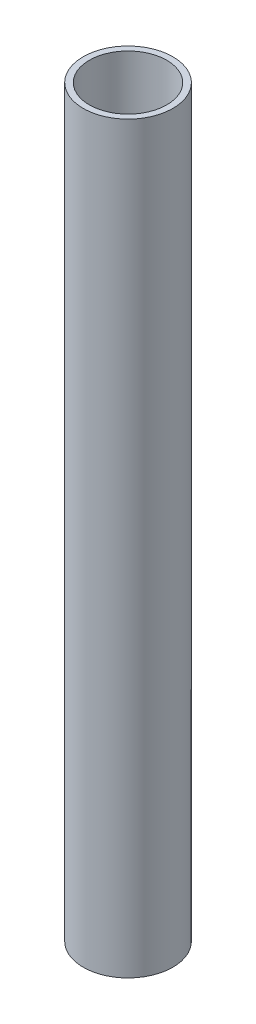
from build123d import *

# Parameters (mm, degrees)
SKETCH1_R           = 7.35
SKETCH1_R_2         = 6.35
BOSS_EXTRUDE1_DEPTH = 122


with BuildPart() as part:
    # Sketch1 → Boss-Extrude1 (new body)
    with BuildSketch(Plane(origin=(0, 0, 0), x_dir=(1, 0, 0), z_dir=(0, 1, 0))):
        with Locations(Location((0, 0, 0), (0, 0, 90))):
            Circle(SKETCH1_R)
        with Locations(Location((0, 0, 0), (0, 0, 90))):
            Circle(SKETCH1_R_2, mode=Mode.SUBTRACT)
    extrude(amount=BOSS_EXTRUDE1_DEPTH)


solid = part.part
